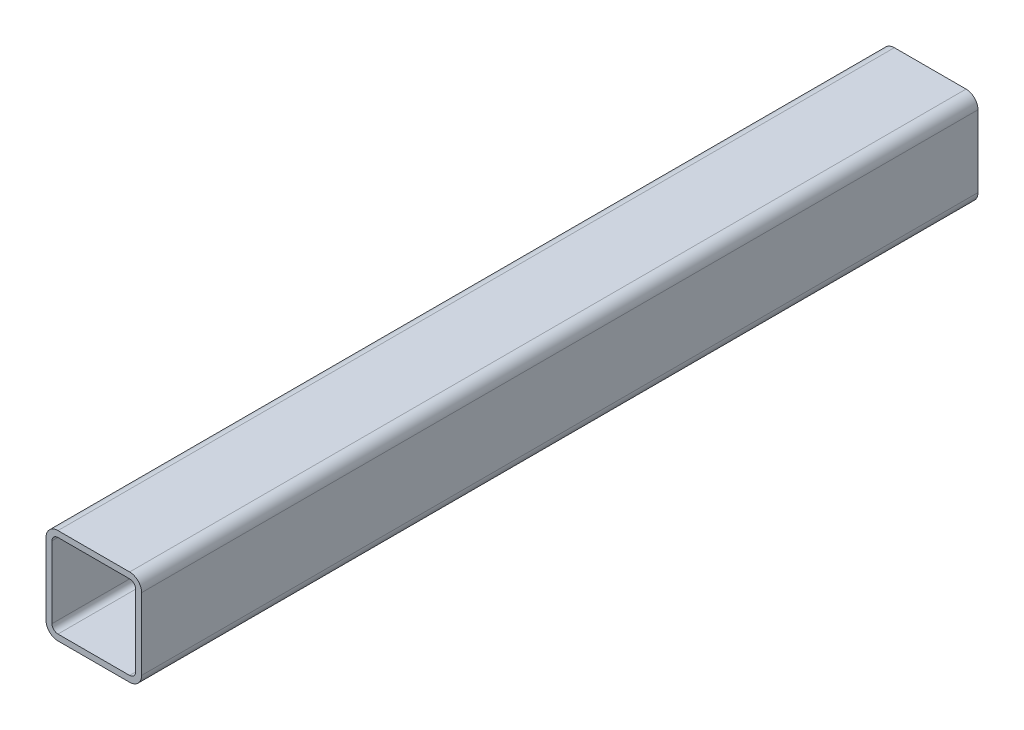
from build123d import *

# Parameters (mm, degrees)
BEAM_6IN_DEPTH      = 152.4
BEAM_6IN_DEPTH_BACK = 1625.6


with BuildPart() as part:
    # 8in beam → Beam 6in (new, two sides: drawn at the far end of the back side and taken through both)
    with BuildSketch(Plane(origin=(0, 0, 0), x_dir=(0, 1, 0), z_dir=(0, 0, 1)).offset(-BEAM_6IN_DEPTH_BACK)):
        with BuildLine():
            Line((-76.2, -101.6), (76.2, -101.6))
            ThreePointArc((76.2, -101.6), (94.160512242, -94.160512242), (101.6, -76.2))
            Line((101.6, -76.2), (101.6, 76.2))
            ThreePointArc((101.6, 76.2), (94.160512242, 94.160512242), (76.2, 101.6))
            Line((76.2, 101.6), (-76.2, 101.6))
            ThreePointArc((-76.2, 101.6), (-94.160512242, 94.160512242), (-101.6, 76.2))
            Line((-101.6, 76.2), (-101.6, -76.2))
            ThreePointArc((-101.6, -76.2), (-94.160512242, -94.160512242), (-76.2, -101.6))
        make_face()
        with BuildLine():
            Line((-76.2, -88.9), (76.2, -88.9))
            ThreePointArc((76.2, -88.9), (85.180256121, -85.180256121), (88.9, -76.2))
            Line((88.9, -76.2), (88.9, 76.2))
            ThreePointArc((88.9, 76.2), (85.180256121, 85.180256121), (76.2, 88.9))
            Line((76.2, 88.9), (-76.2, 88.9))
            ThreePointArc((-76.2, 88.9), (-85.180256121, 85.180256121), (-88.9, 76.2))
            Line((-88.9, 76.2), (-88.9, -76.2))
            ThreePointArc((-88.9, -76.2), (-85.180256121, -85.180256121), (-76.2, -88.9))
        make_face(mode=Mode.SUBTRACT)
    extrude(amount=BEAM_6IN_DEPTH + BEAM_6IN_DEPTH_BACK)


solid = part.part
